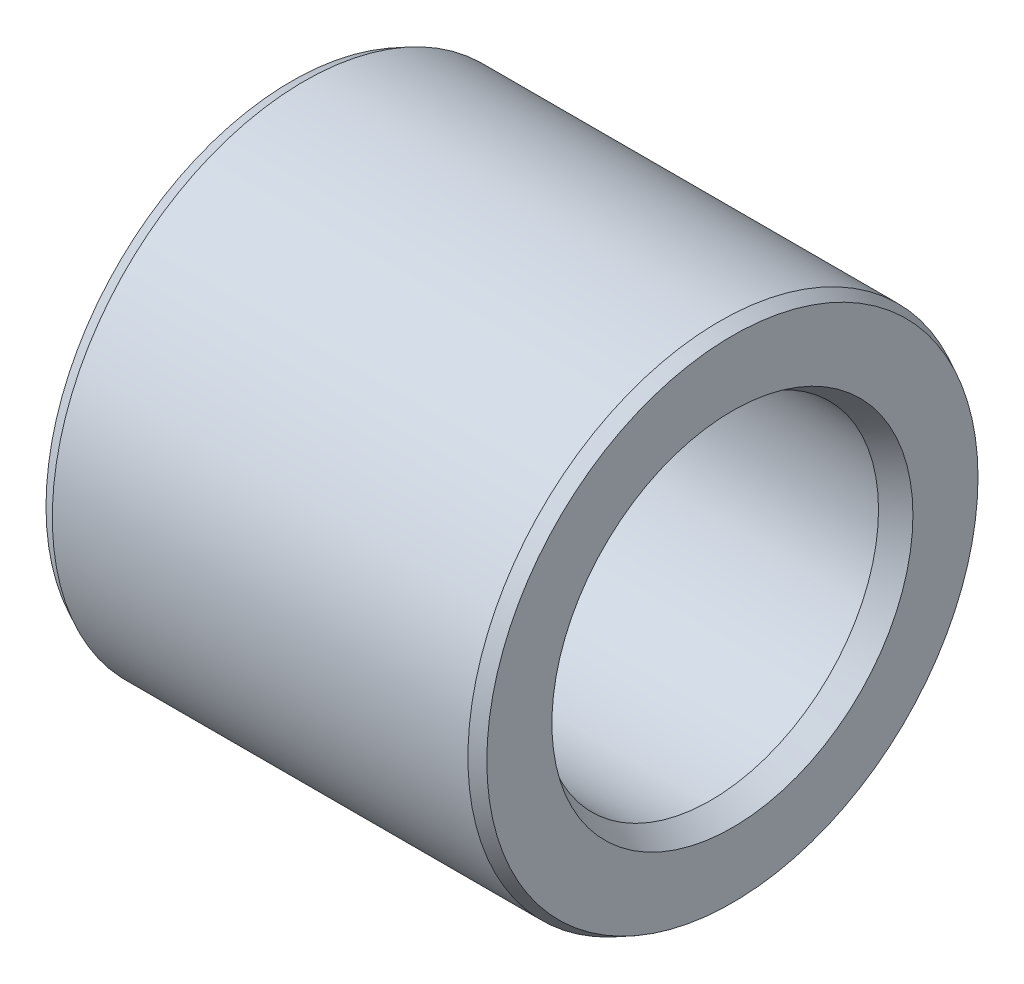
from build123d import *


with BuildPart() as part:
    # Esquisse1 → R_volution1 (revolve)
    with BuildSketch(Plane.XY, mode=Mode.PRIVATE) as r_volution1_sk:
        Polygon((0, 5.85), (0, 4.3), (0.519615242, 4), (9.980384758, 4), (10.5, 4.3), (10.5, 5.85), (10.2, 6), (0.3, 6), align=None)
    revolve(r_volution1_sk.sketch.rotate(Axis((0, 0, 0), (1, 0, 0)), 270), axis=Axis((0, 0, 0), (1, 0, 0)))


solid = part.part
